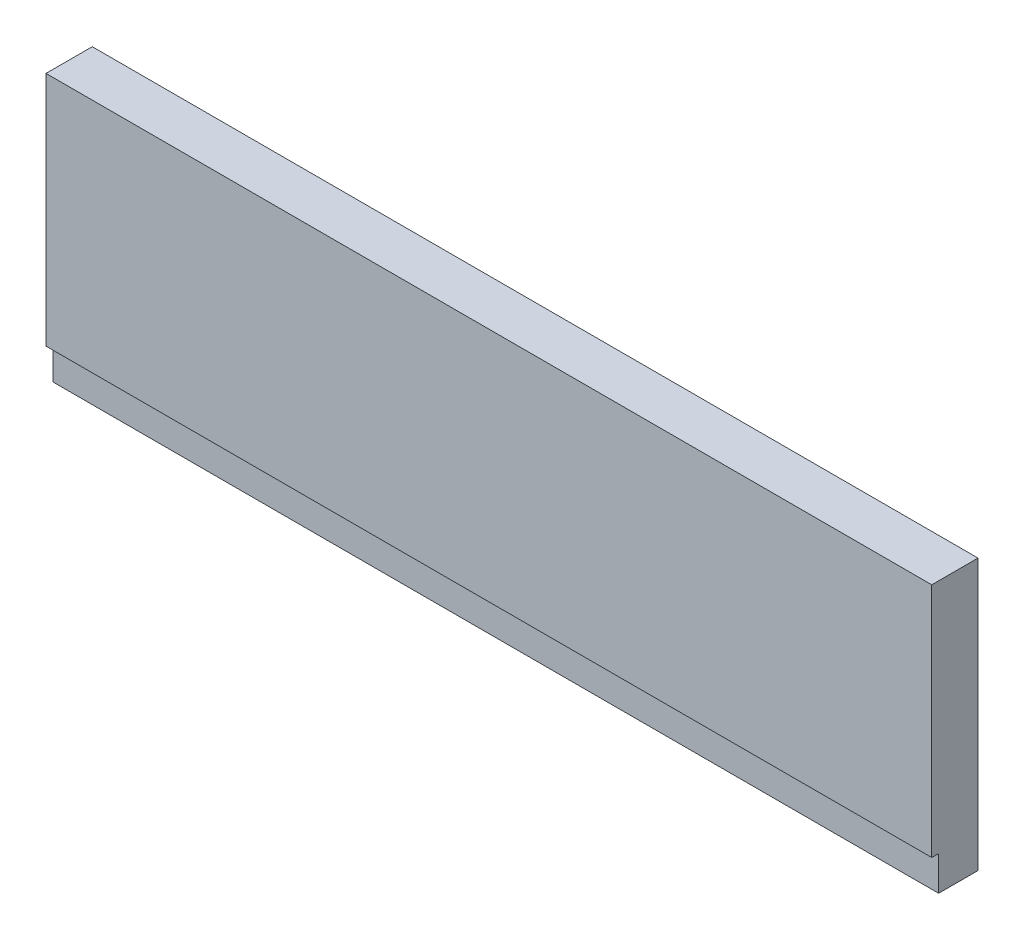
ISO-10303-21;
HEADER;
FILE_DESCRIPTION(('STEP AP214'),'2;1');
FILE_NAME('part.step','',(''),(''),'','','');
FILE_SCHEMA(('AUTOMOTIVE_DESIGN { 1 0 10303 214 1 1 1 1 }'));
ENDSEC;
DATA;
#1=APPLICATION_CONTEXT('core data for automotive mechanical design processes');
#2=APPLICATION_PROTOCOL_DEFINITION('international standard','automotive_design',2000,#1);
#3=PRODUCT_CONTEXT('',#1,'mechanical');
#4=PRODUCT('Part','Part','',(#3));
#5=PRODUCT_RELATED_PRODUCT_CATEGORY('part','',(#4));
#6=PRODUCT_DEFINITION_FORMATION('','',#4);
#7=PRODUCT_DEFINITION_CONTEXT('part definition',#1,'design');
#8=PRODUCT_DEFINITION('design','',#6,#7);
#9=PRODUCT_DEFINITION_SHAPE('','',#8);
#10=(LENGTH_UNIT() NAMED_UNIT(*) SI_UNIT(.MILLI.,.METRE.));
#11=(NAMED_UNIT(*) PLANE_ANGLE_UNIT() SI_UNIT($,.RADIAN.));
#12=(NAMED_UNIT(*) SI_UNIT($,.STERADIAN.) SOLID_ANGLE_UNIT());
#13=UNCERTAINTY_MEASURE_WITH_UNIT(LENGTH_MEASURE(1.E-05),#10,'distance_accuracy_value','');
#14=(GEOMETRIC_REPRESENTATION_CONTEXT(3) GLOBAL_UNCERTAINTY_ASSIGNED_CONTEXT((#13)) GLOBAL_UNIT_ASSIGNED_CONTEXT((#10,
#11,#12)) REPRESENTATION_CONTEXT('',''));
#15=CARTESIAN_POINT('',(0.,0.,0.));
#16=DIRECTION('',(0.,0.,1.));
#17=DIRECTION('',(1.,0.,0.));
#18=AXIS2_PLACEMENT_3D('',#15,#16,#17);
#19=CARTESIAN_POINT('',(-900.,-1786.46075731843,47.));
#20=DIRECTION('',(0.,-1.,0.));
#21=DIRECTION('',(0.,0.,-1.));
#22=AXIS2_PLACEMENT_3D('',#19,#20,#21);
#23=PLANE('',#22);
#24=DIRECTION('',(-1.,0.,0.));
#25=VECTOR('',#24,1.);
#26=CARTESIAN_POINT('',(-900.,-1786.46075731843,0.));
#27=LINE('',#26,#25);
#28=CARTESIAN_POINT('',(2.22044604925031E-13,-1786.46075731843,0.));
#29=VERTEX_POINT('',#28);
#30=CARTESIAN_POINT('',(-900.,-1786.46075731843,0.));
#31=VERTEX_POINT('',#30);
#32=EDGE_CURVE('E93',#29,#31,#27,.T.);
#33=ORIENTED_EDGE('',*,*,#32,.T.);
#34=DIRECTION('',(0.,0.,-1.));
#35=VECTOR('',#34,1.);
#36=CARTESIAN_POINT('',(-900.,-1786.46075731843,47.));
#37=LINE('',#36,#35);
#38=CARTESIAN_POINT('',(-900.,-1786.46075731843,47.));
#39=VERTEX_POINT('',#38);
#40=EDGE_CURVE('E11',#39,#31,#37,.T.);
#41=ORIENTED_EDGE('',*,*,#40,.F.);
#42=DIRECTION('',(-1.,0.,0.));
#43=VECTOR('',#42,1.);
#44=CARTESIAN_POINT('',(-900.,-1786.46075731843,47.));
#45=LINE('',#44,#43);
#46=CARTESIAN_POINT('',(2.22044604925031E-13,-1786.46075731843,47.));
#47=VERTEX_POINT('',#46);
#48=EDGE_CURVE('E96',#47,#39,#45,.T.);
#49=ORIENTED_EDGE('',*,*,#48,.F.);
#50=DIRECTION('',(0.,0.,-1.));
#51=VECTOR('',#50,1.);
#52=CARTESIAN_POINT('',(2.22044604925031E-13,-1786.46075731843,47.));
#53=LINE('',#52,#51);
#54=EDGE_CURVE('E134',#47,#29,#53,.T.);
#55=ORIENTED_EDGE('',*,*,#54,.T.);
#56=EDGE_LOOP('',(#33,#41,#49,#55));
#57=FACE_BOUND('',#56,.T.);
#58=ADVANCED_FACE('F31',(#57),#23,.F.);
#59=CARTESIAN_POINT('',(-900.,-1786.46075731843,47.));
#60=DIRECTION('',(1.,0.,0.));
#61=DIRECTION('',(0.,0.,-1.));
#62=AXIS2_PLACEMENT_3D('',#59,#60,#61);
#63=PLANE('',#62);
#64=DIRECTION('',(0.,-1.,0.));
#65=VECTOR('',#64,1.);
#66=CARTESIAN_POINT('',(-900.,-1786.46075731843,0.));
#67=LINE('',#66,#65);
#68=CARTESIAN_POINT('',(-900.,-2061.46075731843,0.));
#69=VERTEX_POINT('',#68);
#70=EDGE_CURVE('E97',#31,#69,#67,.T.);
#71=ORIENTED_EDGE('',*,*,#70,.T.);
#72=DIRECTION('',(0.,0.,-1.));
#73=VECTOR('',#72,1.);
#74=CARTESIAN_POINT('',(-900.,-2061.46075731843,40.));
#75=LINE('',#74,#73);
#76=CARTESIAN_POINT('',(-900.,-2061.46075731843,40.));
#77=VERTEX_POINT('',#76);
#78=EDGE_CURVE('E104',#77,#69,#75,.T.);
#79=ORIENTED_EDGE('',*,*,#78,.F.);
#80=DIRECTION('',(0.,1.,0.));
#81=VECTOR('',#80,1.);
#82=CARTESIAN_POINT('',(-900.,-2026.46075731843,40.));
#83=LINE('',#82,#81);
#84=CARTESIAN_POINT('',(-900.,-2026.46075731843,40.));
#85=VERTEX_POINT('',#84);
#86=EDGE_CURVE('E105',#77,#85,#83,.T.);
#87=ORIENTED_EDGE('',*,*,#86,.T.);
#88=DIRECTION('',(0.,0.,-1.));
#89=VECTOR('',#88,1.);
#90=CARTESIAN_POINT('',(-900.,-2026.46075731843,47.));
#91=LINE('',#90,#89);
#92=CARTESIAN_POINT('',(-900.,-2026.46075731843,47.));
#93=VERTEX_POINT('',#92);
#94=EDGE_CURVE('E39',#93,#85,#91,.T.);
#95=ORIENTED_EDGE('',*,*,#94,.F.);
#96=DIRECTION('',(0.,-1.,0.));
#97=VECTOR('',#96,1.);
#98=CARTESIAN_POINT('',(-900.,-1786.46075731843,47.));
#99=LINE('',#98,#97);
#100=EDGE_CURVE('E143',#39,#93,#99,.T.);
#101=ORIENTED_EDGE('',*,*,#100,.F.);
#102=ORIENTED_EDGE('',*,*,#40,.T.);
#103=EDGE_LOOP('',(#71,#79,#87,#95,#101,#102));
#104=FACE_BOUND('',#103,.T.);
#105=ADVANCED_FACE('F151',(#104),#63,.F.);
#106=CARTESIAN_POINT('',(2.48126208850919E-13,-2026.46075731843,47.));
#107=DIRECTION('',(0.,1.,0.));
#108=DIRECTION('',(0.,0.,1.));
#109=AXIS2_PLACEMENT_3D('',#106,#107,#108);
#110=PLANE('',#109);
#111=ORIENTED_EDGE('',*,*,#94,.T.);
#112=DIRECTION('',(1.,0.,0.));
#113=VECTOR('',#112,1.);
#114=CARTESIAN_POINT('',(2.48126208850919E-13,-2026.46075731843,40.));
#115=LINE('',#114,#113);
#116=CARTESIAN_POINT('',(2.48126208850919E-13,-2026.46075731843,40.));
#117=VERTEX_POINT('',#116);
#118=EDGE_CURVE('E109',#85,#117,#115,.T.);
#119=ORIENTED_EDGE('',*,*,#118,.T.);
#120=DIRECTION('',(0.,0.,-1.));
#121=VECTOR('',#120,1.);
#122=CARTESIAN_POINT('',(2.48126208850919E-13,-2026.46075731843,47.));
#123=LINE('',#122,#121);
#124=CARTESIAN_POINT('',(2.48126208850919E-13,-2026.46075731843,47.));
#125=VERTEX_POINT('',#124);
#126=EDGE_CURVE('E133',#125,#117,#123,.T.);
#127=ORIENTED_EDGE('',*,*,#126,.F.);
#128=DIRECTION('',(1.,0.,0.));
#129=VECTOR('',#128,1.);
#130=CARTESIAN_POINT('',(2.48126208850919E-13,-2026.46075731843,47.));
#131=LINE('',#130,#129);
#132=EDGE_CURVE('E141',#93,#125,#131,.T.);
#133=ORIENTED_EDGE('',*,*,#132,.F.);
#134=EDGE_LOOP('',(#111,#119,#127,#133));
#135=FACE_BOUND('',#134,.T.);
#136=ADVANCED_FACE('F131',(#135),#110,.F.);
#137=CARTESIAN_POINT('',(2.22044604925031E-13,-1786.46075731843,47.));
#138=DIRECTION('',(-1.,0.,0.));
#139=DIRECTION('',(0.,-1.,0.));
#140=AXIS2_PLACEMENT_3D('',#137,#138,#139);
#141=PLANE('',#140);
#142=DIRECTION('',(0.,1.,0.));
#143=VECTOR('',#142,1.);
#144=CARTESIAN_POINT('',(2.22044604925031E-13,-1786.46075731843,0.));
#145=LINE('',#144,#143);
#146=CARTESIAN_POINT('',(0.,-2061.46075731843,0.));
#147=VERTEX_POINT('',#146);
#148=EDGE_CURVE('E87',#147,#29,#145,.T.);
#149=ORIENTED_EDGE('',*,*,#148,.T.);
#150=ORIENTED_EDGE('',*,*,#54,.F.);
#151=DIRECTION('',(0.,1.,0.));
#152=VECTOR('',#151,1.);
#153=CARTESIAN_POINT('',(2.22044604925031E-13,-1786.46075731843,47.));
#154=LINE('',#153,#152);
#155=EDGE_CURVE('E55',#125,#47,#154,.T.);
#156=ORIENTED_EDGE('',*,*,#155,.F.);
#157=ORIENTED_EDGE('',*,*,#126,.T.);
#158=DIRECTION('',(0.,-1.,0.));
#159=VECTOR('',#158,1.);
#160=CARTESIAN_POINT('',(2.48126208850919E-13,-2026.46075731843,40.));
#161=LINE('',#160,#159);
#162=CARTESIAN_POINT('',(0.,-2061.46075731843,40.));
#163=VERTEX_POINT('',#162);
#164=EDGE_CURVE('E47',#117,#163,#161,.T.);
#165=ORIENTED_EDGE('',*,*,#164,.T.);
#166=DIRECTION('',(0.,0.,-1.));
#167=VECTOR('',#166,1.);
#168=CARTESIAN_POINT('',(0.,-2061.46075731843,40.));
#169=LINE('',#168,#167);
#170=EDGE_CURVE('E99',#163,#147,#169,.T.);
#171=ORIENTED_EDGE('',*,*,#170,.T.);
#172=EDGE_LOOP('',(#149,#150,#156,#157,#165,#171));
#173=FACE_BOUND('',#172,.T.);
#174=ADVANCED_FACE('F100',(#173),#141,.F.);
#175=CARTESIAN_POINT('',(-900.,-1786.46075731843,47.));
#176=DIRECTION('',(0.,0.,-1.));
#177=DIRECTION('',(-1.,0.,0.));
#178=AXIS2_PLACEMENT_3D('',#175,#176,#177);
#179=PLANE('',#178);
#180=ORIENTED_EDGE('',*,*,#48,.T.);
#181=ORIENTED_EDGE('',*,*,#100,.T.);
#182=ORIENTED_EDGE('',*,*,#132,.T.);
#183=ORIENTED_EDGE('',*,*,#155,.T.);
#184=EDGE_LOOP('',(#180,#181,#182,#183));
#185=FACE_BOUND('',#184,.T.);
#186=ADVANCED_FACE('F150',(#185),#179,.F.);
#187=CARTESIAN_POINT('',(-900.,-1786.46075731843,0.));
#188=DIRECTION('',(0.,0.,-1.));
#189=DIRECTION('',(-1.,0.,0.));
#190=AXIS2_PLACEMENT_3D('',#187,#188,#189);
#191=PLANE('',#190);
#192=ORIENTED_EDGE('',*,*,#32,.F.);
#193=ORIENTED_EDGE('',*,*,#148,.F.);
#194=DIRECTION('',(-1.,0.,0.));
#195=VECTOR('',#194,1.);
#196=CARTESIAN_POINT('',(-900.,-2061.46075731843,0.));
#197=LINE('',#196,#195);
#198=EDGE_CURVE('E91',#147,#69,#197,.T.);
#199=ORIENTED_EDGE('',*,*,#198,.T.);
#200=ORIENTED_EDGE('',*,*,#70,.F.);
#201=EDGE_LOOP('',(#192,#193,#199,#200));
#202=FACE_BOUND('',#201,.T.);
#203=ADVANCED_FACE('F89',(#202),#191,.T.);
#204=CARTESIAN_POINT('',(-900.,-2061.46075731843,40.));
#205=DIRECTION('',(0.,-1.,0.));
#206=DIRECTION('',(0.,0.,-1.));
#207=AXIS2_PLACEMENT_3D('',#204,#205,#206);
#208=PLANE('',#207);
#209=ORIENTED_EDGE('',*,*,#198,.F.);
#210=ORIENTED_EDGE('',*,*,#170,.F.);
#211=DIRECTION('',(-1.,0.,0.));
#212=VECTOR('',#211,1.);
#213=CARTESIAN_POINT('',(-900.,-2061.46075731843,40.));
#214=LINE('',#213,#212);
#215=EDGE_CURVE('E115',#163,#77,#214,.T.);
#216=ORIENTED_EDGE('',*,*,#215,.T.);
#217=ORIENTED_EDGE('',*,*,#78,.T.);
#218=EDGE_LOOP('',(#209,#210,#216,#217));
#219=FACE_BOUND('',#218,.T.);
#220=ADVANCED_FACE('F108',(#219),#208,.T.);
#221=CARTESIAN_POINT('',(-900.,-2026.46075731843,40.));
#222=DIRECTION('',(0.,0.,1.));
#223=DIRECTION('',(1.,0.,0.));
#224=AXIS2_PLACEMENT_3D('',#221,#222,#223);
#225=PLANE('',#224);
#226=ORIENTED_EDGE('',*,*,#118,.F.);
#227=ORIENTED_EDGE('',*,*,#86,.F.);
#228=ORIENTED_EDGE('',*,*,#215,.F.);
#229=ORIENTED_EDGE('',*,*,#164,.F.);
#230=EDGE_LOOP('',(#226,#227,#228,#229));
#231=FACE_BOUND('',#230,.T.);
#232=ADVANCED_FACE('F128',(#231),#225,.T.);
#233=CLOSED_SHELL('',(#58,#105,#136,#174,#186,#203,#220,#232));
#234=MANIFOLD_SOLID_BREP('B2',#233);
#235=ADVANCED_BREP_SHAPE_REPRESENTATION('',(#18,#234),#14);
#236=SHAPE_DEFINITION_REPRESENTATION(#9,#235);
ENDSEC;
END-ISO-10303-21;
